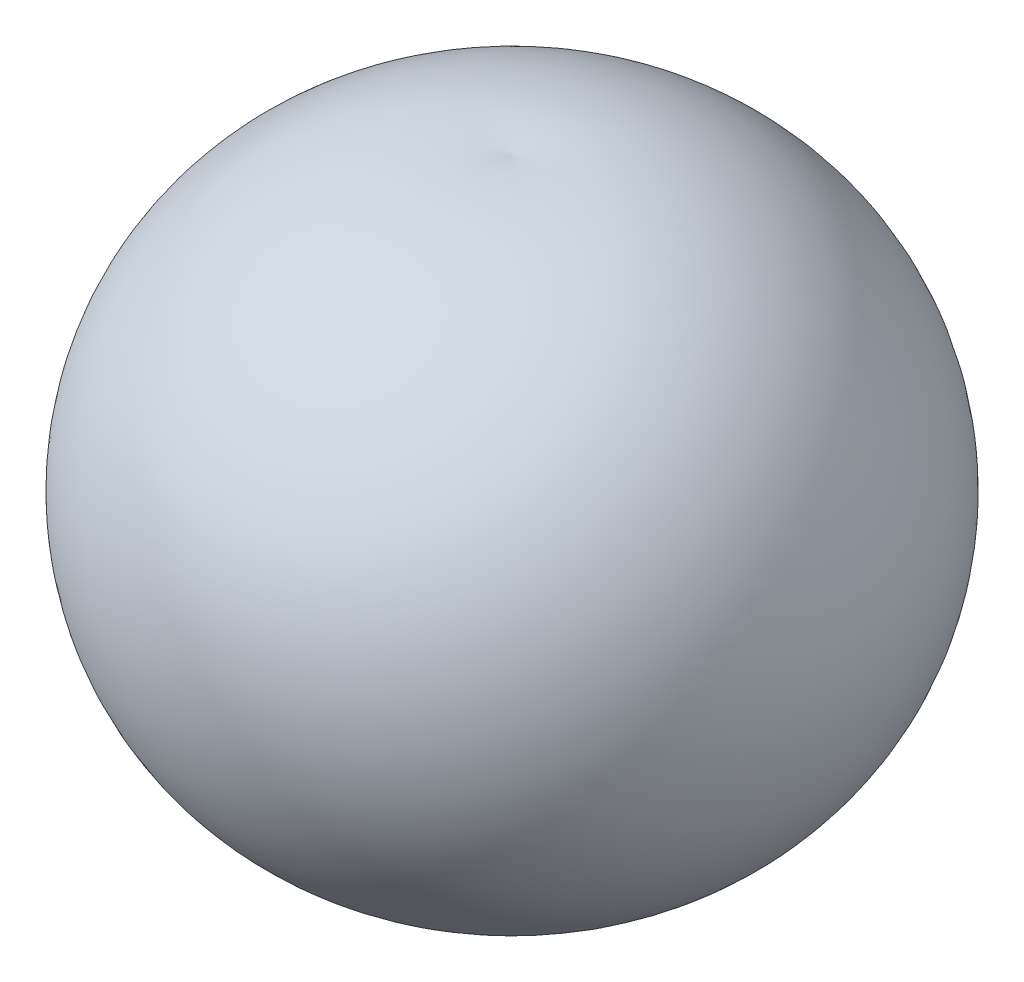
ISO-10303-21;
HEADER;
FILE_DESCRIPTION(('STEP AP214'),'2;1');
FILE_NAME('part.step','',(''),(''),'','','');
FILE_SCHEMA(('AUTOMOTIVE_DESIGN { 1 0 10303 214 1 1 1 1 }'));
ENDSEC;
DATA;
#1=APPLICATION_CONTEXT('core data for automotive mechanical design processes');
#2=APPLICATION_PROTOCOL_DEFINITION('international standard','automotive_design',2000,#1);
#3=PRODUCT_CONTEXT('',#1,'mechanical');
#4=PRODUCT('Part','Part','',(#3));
#5=PRODUCT_RELATED_PRODUCT_CATEGORY('part','',(#4));
#6=PRODUCT_DEFINITION_FORMATION('','',#4);
#7=PRODUCT_DEFINITION_CONTEXT('part definition',#1,'design');
#8=PRODUCT_DEFINITION('design','',#6,#7);
#9=PRODUCT_DEFINITION_SHAPE('','',#8);
#10=(LENGTH_UNIT() NAMED_UNIT(*) SI_UNIT(.MILLI.,.METRE.));
#11=(NAMED_UNIT(*) PLANE_ANGLE_UNIT() SI_UNIT($,.RADIAN.));
#12=(NAMED_UNIT(*) SI_UNIT($,.STERADIAN.) SOLID_ANGLE_UNIT());
#13=UNCERTAINTY_MEASURE_WITH_UNIT(LENGTH_MEASURE(1.E-05),#10,'distance_accuracy_value','');
#14=(GEOMETRIC_REPRESENTATION_CONTEXT(3) GLOBAL_UNCERTAINTY_ASSIGNED_CONTEXT((#13)) GLOBAL_UNIT_ASSIGNED_CONTEXT((#10,
#11,#12)) REPRESENTATION_CONTEXT('',''));
#15=CARTESIAN_POINT('',(0.,0.,0.));
#16=DIRECTION('',(0.,0.,1.));
#17=DIRECTION('',(1.,0.,0.));
#18=AXIS2_PLACEMENT_3D('',#15,#16,#17);
#19=CARTESIAN_POINT('',(0.,-99.6152422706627,485.000000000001));
#20=DIRECTION('',(-1.,0.,0.));
#21=DIRECTION('',(0.,0.,1.));
#22=AXIS2_PLACEMENT_3D('',#19,#20,#21);
#23=CIRCLE('',#22,935.726);
#24=TRIMMED_CURVE('',#23,(PARAMETER_VALUE(-2.11567474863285)),
(PARAMETER_VALUE(2.11567474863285)),.T.,.PARAMETER.);
#25=CARTESIAN_POINT('',(0.,-99.6152422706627,0.));
#26=DIRECTION('',(0.,1.,0.));
#27=AXIS1_PLACEMENT('',#25,#26);
#28=SURFACE_OF_REVOLUTION('',#24,#27);
#29=CARTESIAN_POINT('',(0.,-909.977729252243,0.));
#30=DIRECTION('',(0.,1.,0.));
#31=DIRECTION('',(0.,0.,1.));
#32=AXIS2_PLACEMENT_3D('',#29,#30,#31);
#33=CIRCLE('',#32,952.86300000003);
#34=CARTESIAN_POINT('',(0.,-909.977729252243,952.86300000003));
#35=VERTEX_POINT('',#34);
#36=EDGE_CURVE('E43',#35,#35,#33,.T.);
#37=ORIENTED_EDGE('',*,*,#36,.F.);
#38=EDGE_LOOP('',(#37));
#39=FACE_BOUND('',#38,.T.);
#40=CARTESIAN_POINT('',(0.,-899.839052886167,0.));
#41=VERTEX_POINT('',#40);
#42=VERTEX_LOOP('',#41);
#43=FACE_BOUND('',#42,.T.);
#44=ADVANCED_FACE('F35',(#39,#43),#28,.T.);
#45=CARTESIAN_POINT('',(0.,420.,185.));
#46=DIRECTION('',(-1.,0.,0.));
#47=DIRECTION('',(0.,0.,1.));
#48=AXIS2_PLACEMENT_3D('',#45,#46,#47);
#49=CIRCLE('',#48,1535.726);
#50=TRIMMED_CURVE('',#49,(PARAMETER_VALUE(-1.69155379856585)),
(PARAMETER_VALUE(1.69155379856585)),.T.,.PARAMETER.);
#51=CARTESIAN_POINT('',(0.,420.,0.));
#52=DIRECTION('',(0.,1.,0.));
#53=AXIS1_PLACEMENT('',#51,#52);
#54=SURFACE_OF_REVOLUTION('',#50,#53);
#55=CARTESIAN_POINT('',(1.64035451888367E-11,1944.54234020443,0.));
#56=VERTEX_POINT('',#55);
#57=VERTEX_LOOP('',#56);
#58=FACE_BOUND('',#57,.T.);
#59=ORIENTED_EDGE('',*,*,#36,.T.);
#60=EDGE_LOOP('',(#59));
#61=FACE_BOUND('',#60,.T.);
#62=ADVANCED_FACE('F56',(#58,#61),#54,.T.);
#63=CLOSED_SHELL('',(#44,#62));
#64=CARTESIAN_POINT('',(0.,420.,185.));
#65=DIRECTION('',(-1.,0.,0.));
#66=DIRECTION('',(0.,0.,1.));
#67=AXIS2_PLACEMENT_3D('',#64,#65,#66);
#68=CIRCLE('',#67,404.855);
#69=TRIMMED_CURVE('',#68,(PARAMETER_VALUE(-2.04536375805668)),
(PARAMETER_VALUE(2.04536375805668)),.T.,.PARAMETER.);
#70=CARTESIAN_POINT('',(0.,420.,0.));
#71=DIRECTION('',(0.,1.,0.));
#72=AXIS1_PLACEMENT('',#70,#71);
#73=SURFACE_OF_REVOLUTION('',#69,#72);
#74=CARTESIAN_POINT('',(2.22044604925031E-13,59.8853362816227,0.));
#75=VERTEX_POINT('',#74);
#76=VERTEX_LOOP('',#75);
#77=FACE_BOUND('',#76,.T.);
#78=CARTESIAN_POINT('',(0.,672.718544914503,0.));
#79=DIRECTION('',(0.,1.,0.));
#80=DIRECTION('',(0.,0.,1.));
#81=AXIS2_PLACEMENT_3D('',#78,#79,#80);
#82=CIRCLE('',#81,501.292440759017);
#83=CARTESIAN_POINT('',(0.,672.718544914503,501.292440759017));
#84=VERTEX_POINT('',#83);
#85=EDGE_CURVE('E11',#84,#84,#82,.T.);
#86=ORIENTED_EDGE('',*,*,#85,.T.);
#87=EDGE_LOOP('',(#86));
#88=FACE_BOUND('',#87,.T.);
#89=ADVANCED_FACE('F74',(#77,#88),#73,.F.);
#90=CARTESIAN_POINT('',(0.,472.293445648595,-412.716818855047));
#91=DIRECTION('',(-1.,0.,0.));
#92=DIRECTION('',(0.,0.,1.));
#93=AXIS2_PLACEMENT_3D('',#90,#91,#92);
#94=CIRCLE('',#93,935.726);
#95=TRIMMED_CURVE('',#94,(PARAMETER_VALUE(-1.11401034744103)),
(PARAMETER_VALUE(1.11401034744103)),.T.,.PARAMETER.);
#96=CARTESIAN_POINT('',(0.,472.293445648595,0.));
#97=DIRECTION('',(0.,1.,0.));
#98=AXIS1_PLACEMENT('',#96,#97);
#99=SURFACE_OF_REVOLUTION('',#95,#98);
#100=ORIENTED_EDGE('',*,*,#85,.F.);
#101=EDGE_LOOP('',(#100));
#102=FACE_BOUND('',#101,.T.);
#103=CARTESIAN_POINT('',(1.62647673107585E-11,1312.08388052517,0.));
#104=VERTEX_POINT('',#103);
#105=VERTEX_LOOP('',#104);
#106=FACE_BOUND('',#105,.T.);
#107=ADVANCED_FACE('F77',(#102,#106),#99,.F.);
#108=CLOSED_SHELL('',(#89,#107));
#109=ORIENTED_CLOSED_SHELL('',*,#108,.T.);
#110=BREP_WITH_VOIDS('B2',#63,(#109));
#111=ADVANCED_BREP_SHAPE_REPRESENTATION('',(#18,#110),#14);
#112=SHAPE_DEFINITION_REPRESENTATION(#9,#111);
ENDSEC;
END-ISO-10303-21;
